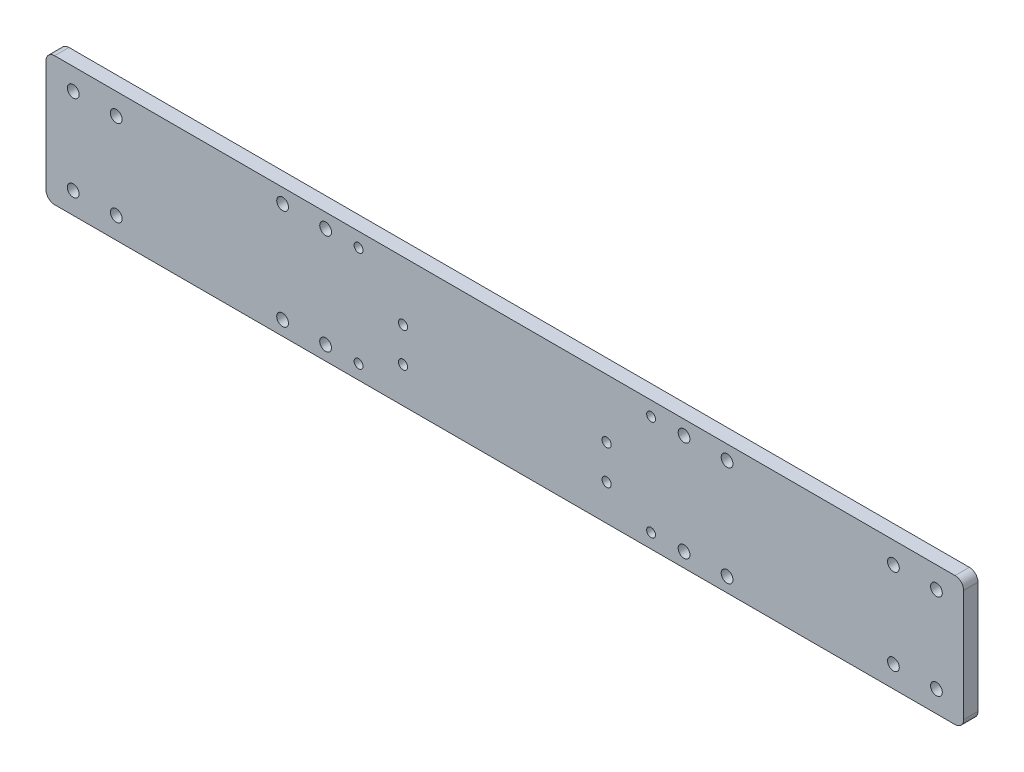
ISO-10303-21;
HEADER;
FILE_DESCRIPTION(('STEP AP214'),'2;1');
FILE_NAME('part.step','',(''),(''),'','','');
FILE_SCHEMA(('AUTOMOTIVE_DESIGN { 1 0 10303 214 1 1 1 1 }'));
ENDSEC;
DATA;
#1=APPLICATION_CONTEXT('core data for automotive mechanical design processes');
#2=APPLICATION_PROTOCOL_DEFINITION('international standard','automotive_design',2000,#1);
#3=PRODUCT_CONTEXT('',#1,'mechanical');
#4=PRODUCT('Part','Part','',(#3));
#5=PRODUCT_RELATED_PRODUCT_CATEGORY('part','',(#4));
#6=PRODUCT_DEFINITION_FORMATION('','',#4);
#7=PRODUCT_DEFINITION_CONTEXT('part definition',#1,'design');
#8=PRODUCT_DEFINITION('design','',#6,#7);
#9=PRODUCT_DEFINITION_SHAPE('','',#8);
#10=(LENGTH_UNIT() NAMED_UNIT(*) SI_UNIT(.MILLI.,.METRE.));
#11=(NAMED_UNIT(*) PLANE_ANGLE_UNIT() SI_UNIT($,.RADIAN.));
#12=(NAMED_UNIT(*) SI_UNIT($,.STERADIAN.) SOLID_ANGLE_UNIT());
#13=UNCERTAINTY_MEASURE_WITH_UNIT(LENGTH_MEASURE(1.E-05),#10,'distance_accuracy_value','');
#14=(GEOMETRIC_REPRESENTATION_CONTEXT(3) GLOBAL_UNCERTAINTY_ASSIGNED_CONTEXT((#13)) GLOBAL_UNIT_ASSIGNED_CONTEXT((#10,
#11,#12)) REPRESENTATION_CONTEXT('',''));
#15=CARTESIAN_POINT('',(0.,0.,0.));
#16=DIRECTION('',(0.,0.,1.));
#17=DIRECTION('',(1.,0.,0.));
#18=AXIS2_PLACEMENT_3D('',#15,#16,#17);
#19=CARTESIAN_POINT('',(0.,0.,5.));
#20=DIRECTION('',(0.,0.,-1.));
#21=DIRECTION('',(-1.,0.,0.));
#22=AXIS2_PLACEMENT_3D('',#19,#20,#21);
#23=PLANE('',#22);
#24=CARTESIAN_POINT('',(35.5,1.99999999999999,5.));
#25=DIRECTION('',(0.,0.,1.));
#26=DIRECTION('',(1.,0.,0.));
#27=AXIS2_PLACEMENT_3D('',#24,#25,#26);
#28=CIRCLE('',#27,1.6);
#29=CARTESIAN_POINT('',(37.1,1.99999999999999,5.));
#30=VERTEX_POINT('',#29);
#31=EDGE_CURVE('E162',#30,#30,#28,.T.);
#32=ORIENTED_EDGE('',*,*,#31,.F.);
#33=EDGE_LOOP('',(#32));
#34=FACE_BOUND('',#33,.T.);
#35=CARTESIAN_POINT('',(35.5000000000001,-10.,5.));
#36=DIRECTION('',(0.,0.,1.));
#37=DIRECTION('',(1.,0.,0.));
#38=AXIS2_PLACEMENT_3D('',#35,#36,#37);
#39=CIRCLE('',#38,1.6);
#40=CARTESIAN_POINT('',(37.1000000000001,-10.,5.));
#41=VERTEX_POINT('',#40);
#42=EDGE_CURVE('E319',#41,#41,#39,.T.);
#43=ORIENTED_EDGE('',*,*,#42,.F.);
#44=EDGE_LOOP('',(#43));
#45=FACE_BOUND('',#44,.T.);
#46=CARTESIAN_POINT('',(-35.4999999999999,-10.,5.));
#47=DIRECTION('',(0.,0.,1.));
#48=DIRECTION('',(1.,0.,0.));
#49=AXIS2_PLACEMENT_3D('',#46,#47,#48);
#50=CIRCLE('',#49,1.6);
#51=CARTESIAN_POINT('',(-33.8999999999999,-10.,5.));
#52=VERTEX_POINT('',#51);
#53=EDGE_CURVE('E316',#52,#52,#50,.T.);
#54=ORIENTED_EDGE('',*,*,#53,.F.);
#55=EDGE_LOOP('',(#54));
#56=FACE_BOUND('',#55,.T.);
#57=CARTESIAN_POINT('',(-35.5,1.99999999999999,5.));
#58=DIRECTION('',(0.,0.,1.));
#59=DIRECTION('',(1.,0.,0.));
#60=AXIS2_PLACEMENT_3D('',#57,#58,#59);
#61=CIRCLE('',#60,1.6);
#62=CARTESIAN_POINT('',(-33.9,1.99999999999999,5.));
#63=VERTEX_POINT('',#62);
#64=EDGE_CURVE('E157',#63,#63,#61,.T.);
#65=ORIENTED_EDGE('',*,*,#64,.F.);
#66=EDGE_LOOP('',(#65));
#67=FACE_BOUND('',#66,.T.);
#68=CARTESIAN_POINT('',(51.0000000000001,17.5,5.));
#69=DIRECTION('',(0.,0.,1.));
#70=DIRECTION('',(1.,0.,0.));
#71=AXIS2_PLACEMENT_3D('',#68,#69,#70);
#72=CIRCLE('',#71,1.54999999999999);
#73=CARTESIAN_POINT('',(52.5500000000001,17.5,5.));
#74=VERTEX_POINT('',#73);
#75=EDGE_CURVE('E147',#74,#74,#72,.T.);
#76=ORIENTED_EDGE('',*,*,#75,.F.);
#77=EDGE_LOOP('',(#76));
#78=FACE_BOUND('',#77,.T.);
#79=CARTESIAN_POINT('',(-50.9999999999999,-17.5,5.));
#80=DIRECTION('',(0.,0.,1.));
#81=DIRECTION('',(-1.,0.,0.));
#82=AXIS2_PLACEMENT_3D('',#79,#80,#81);
#83=CIRCLE('',#82,1.54999999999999);
#84=CARTESIAN_POINT('',(-52.5499999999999,-17.5,5.));
#85=VERTEX_POINT('',#84);
#86=EDGE_CURVE('E309',#85,#85,#83,.T.);
#87=ORIENTED_EDGE('',*,*,#86,.F.);
#88=EDGE_LOOP('',(#87));
#89=FACE_BOUND('',#88,.T.);
#90=CARTESIAN_POINT('',(51.0000000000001,-17.5,5.));
#91=DIRECTION('',(0.,0.,1.));
#92=DIRECTION('',(-1.,0.,0.));
#93=AXIS2_PLACEMENT_3D('',#90,#91,#92);
#94=CIRCLE('',#93,1.54999999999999);
#95=CARTESIAN_POINT('',(49.4500000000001,-17.5,5.));
#96=VERTEX_POINT('',#95);
#97=EDGE_CURVE('E156',#96,#96,#94,.T.);
#98=ORIENTED_EDGE('',*,*,#97,.F.);
#99=EDGE_LOOP('',(#98));
#100=FACE_BOUND('',#99,.T.);
#101=CARTESIAN_POINT('',(-50.9999999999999,17.5,5.));
#102=DIRECTION('',(0.,0.,1.));
#103=DIRECTION('',(1.,0.,0.));
#104=AXIS2_PLACEMENT_3D('',#101,#102,#103);
#105=CIRCLE('',#104,1.54999999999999);
#106=CARTESIAN_POINT('',(-49.4499999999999,17.5,5.));
#107=VERTEX_POINT('',#106);
#108=EDGE_CURVE('E142',#107,#107,#105,.T.);
#109=ORIENTED_EDGE('',*,*,#108,.F.);
#110=EDGE_LOOP('',(#109));
#111=FACE_BOUND('',#110,.T.);
#112=DIRECTION('',(-1.,0.,0.));
#113=VECTOR('',#112,1.);
#114=CARTESIAN_POINT('',(0.,22.5,5.));
#115=LINE('',#114,#113);
#116=CARTESIAN_POINT('',(157.,22.5,5.));
#117=VERTEX_POINT('',#116);
#118=CARTESIAN_POINT('',(-157.,22.5,5.));
#119=VERTEX_POINT('',#118);
#120=EDGE_CURVE('E201',#117,#119,#115,.T.);
#121=ORIENTED_EDGE('',*,*,#120,.T.);
#122=CARTESIAN_POINT('',(-157.,19.5,5.));
#123=DIRECTION('',(0.,0.,-1.));
#124=DIRECTION('',(-1.,0.,0.));
#125=AXIS2_PLACEMENT_3D('',#122,#123,#124);
#126=CIRCLE('',#125,3.);
#127=CARTESIAN_POINT('',(-160.,19.5,5.));
#128=VERTEX_POINT('',#127);
#129=EDGE_CURVE('E182',#119,#128,#126,.F.);
#130=ORIENTED_EDGE('',*,*,#129,.T.);
#131=DIRECTION('',(0.,-1.,0.));
#132=VECTOR('',#131,1.);
#133=CARTESIAN_POINT('',(-160.,-22.5,5.));
#134=LINE('',#133,#132);
#135=CARTESIAN_POINT('',(-160.,-19.5,5.));
#136=VERTEX_POINT('',#135);
#137=EDGE_CURVE('E122',#128,#136,#134,.T.);
#138=ORIENTED_EDGE('',*,*,#137,.T.);
#139=CARTESIAN_POINT('',(-157.,-19.5,5.));
#140=DIRECTION('',(0.,0.,-1.));
#141=DIRECTION('',(-1.,0.,0.));
#142=AXIS2_PLACEMENT_3D('',#139,#140,#141);
#143=CIRCLE('',#142,3.);
#144=CARTESIAN_POINT('',(-157.,-22.5,5.));
#145=VERTEX_POINT('',#144);
#146=EDGE_CURVE('E58',#136,#145,#143,.F.);
#147=ORIENTED_EDGE('',*,*,#146,.T.);
#148=DIRECTION('',(1.,0.,0.));
#149=VECTOR('',#148,1.);
#150=CARTESIAN_POINT('',(-160.,-22.5,5.));
#151=LINE('',#150,#149);
#152=CARTESIAN_POINT('',(157.,-22.5,5.));
#153=VERTEX_POINT('',#152);
#154=EDGE_CURVE('E168',#145,#153,#151,.T.);
#155=ORIENTED_EDGE('',*,*,#154,.T.);
#156=CARTESIAN_POINT('',(157.,-19.5,5.));
#157=DIRECTION('',(0.,0.,-1.));
#158=DIRECTION('',(-1.,0.,0.));
#159=AXIS2_PLACEMENT_3D('',#156,#157,#158);
#160=CIRCLE('',#159,3.);
#161=CARTESIAN_POINT('',(160.,-19.5,5.));
#162=VERTEX_POINT('',#161);
#163=EDGE_CURVE('E179',#153,#162,#160,.F.);
#164=ORIENTED_EDGE('',*,*,#163,.T.);
#165=DIRECTION('',(0.,1.,0.));
#166=VECTOR('',#165,1.);
#167=CARTESIAN_POINT('',(160.,-22.5,5.));
#168=LINE('',#167,#166);
#169=CARTESIAN_POINT('',(160.,19.5,5.));
#170=VERTEX_POINT('',#169);
#171=EDGE_CURVE('E132',#162,#170,#168,.T.);
#172=ORIENTED_EDGE('',*,*,#171,.T.);
#173=CARTESIAN_POINT('',(157.,19.5,5.));
#174=DIRECTION('',(0.,0.,-1.));
#175=DIRECTION('',(-1.,0.,0.));
#176=AXIS2_PLACEMENT_3D('',#173,#174,#175);
#177=CIRCLE('',#176,3.);
#178=EDGE_CURVE('E177',#170,#117,#177,.F.);
#179=ORIENTED_EDGE('',*,*,#178,.T.);
#180=EDGE_LOOP('',(#121,#130,#138,#147,#155,#164,#172,#179));
#181=FACE_BOUND('',#180,.T.);
#182=CARTESIAN_POINT('',(-150.5,15.,5.));
#183=DIRECTION('',(0.,0.,1.));
#184=DIRECTION('',(1.,0.,0.));
#185=AXIS2_PLACEMENT_3D('',#182,#183,#184);
#186=CIRCLE('',#185,2.04999999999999);
#187=CARTESIAN_POINT('',(-148.45,15.,5.));
#188=VERTEX_POINT('',#187);
#189=EDGE_CURVE('E206',#188,#188,#186,.T.);
#190=ORIENTED_EDGE('',*,*,#189,.F.);
#191=EDGE_LOOP('',(#190));
#192=FACE_BOUND('',#191,.T.);
#193=CARTESIAN_POINT('',(-77.5,17.5,5.));
#194=DIRECTION('',(0.,0.,1.));
#195=DIRECTION('',(1.,0.,0.));
#196=AXIS2_PLACEMENT_3D('',#193,#194,#195);
#197=CIRCLE('',#196,2.04999999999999);
#198=CARTESIAN_POINT('',(-75.45,17.5,5.));
#199=VERTEX_POINT('',#198);
#200=EDGE_CURVE('E215',#199,#199,#197,.T.);
#201=ORIENTED_EDGE('',*,*,#200,.F.);
#202=EDGE_LOOP('',(#201));
#203=FACE_BOUND('',#202,.T.);
#204=CARTESIAN_POINT('',(62.5000000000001,-17.5,5.));
#205=DIRECTION('',(0.,0.,1.));
#206=DIRECTION('',(-1.,0.,0.));
#207=AXIS2_PLACEMENT_3D('',#204,#205,#206);
#208=CIRCLE('',#207,2.04999999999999);
#209=CARTESIAN_POINT('',(60.4500000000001,-17.5,5.));
#210=VERTEX_POINT('',#209);
#211=EDGE_CURVE('E220',#210,#210,#208,.T.);
#212=ORIENTED_EDGE('',*,*,#211,.F.);
#213=EDGE_LOOP('',(#212));
#214=FACE_BOUND('',#213,.T.);
#215=CARTESIAN_POINT('',(150.5,15.,5.));
#216=DIRECTION('',(0.,0.,1.));
#217=DIRECTION('',(-1.,0.,0.));
#218=AXIS2_PLACEMENT_3D('',#215,#216,#217);
#219=CIRCLE('',#218,2.04999999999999);
#220=CARTESIAN_POINT('',(148.45,15.,5.));
#221=VERTEX_POINT('',#220);
#222=EDGE_CURVE('E226',#221,#221,#219,.T.);
#223=ORIENTED_EDGE('',*,*,#222,.F.);
#224=EDGE_LOOP('',(#223));
#225=FACE_BOUND('',#224,.T.);
#226=CARTESIAN_POINT('',(-135.5,15.,5.));
#227=DIRECTION('',(0.,0.,1.));
#228=DIRECTION('',(1.,0.,0.));
#229=AXIS2_PLACEMENT_3D('',#226,#227,#228);
#230=CIRCLE('',#229,2.04999999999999);
#231=CARTESIAN_POINT('',(-133.45,15.,5.));
#232=VERTEX_POINT('',#231);
#233=EDGE_CURVE('E232',#232,#232,#230,.T.);
#234=ORIENTED_EDGE('',*,*,#233,.F.);
#235=EDGE_LOOP('',(#234));
#236=FACE_BOUND('',#235,.T.);
#237=CARTESIAN_POINT('',(-135.5,-15.,5.));
#238=DIRECTION('',(0.,0.,1.));
#239=DIRECTION('',(1.,0.,0.));
#240=AXIS2_PLACEMENT_3D('',#237,#238,#239);
#241=CIRCLE('',#240,2.04999999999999);
#242=CARTESIAN_POINT('',(-133.45,-15.,5.));
#243=VERTEX_POINT('',#242);
#244=EDGE_CURVE('E238',#243,#243,#241,.T.);
#245=ORIENTED_EDGE('',*,*,#244,.F.);
#246=EDGE_LOOP('',(#245));
#247=FACE_BOUND('',#246,.T.);
#248=CARTESIAN_POINT('',(-150.5,-15.,5.));
#249=DIRECTION('',(0.,0.,1.));
#250=DIRECTION('',(1.,0.,0.));
#251=AXIS2_PLACEMENT_3D('',#248,#249,#250);
#252=CIRCLE('',#251,2.04999999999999);
#253=CARTESIAN_POINT('',(-148.45,-15.,5.));
#254=VERTEX_POINT('',#253);
#255=EDGE_CURVE('E244',#254,#254,#252,.T.);
#256=ORIENTED_EDGE('',*,*,#255,.F.);
#257=EDGE_LOOP('',(#256));
#258=FACE_BOUND('',#257,.T.);
#259=CARTESIAN_POINT('',(150.5,-15.,5.));
#260=DIRECTION('',(0.,0.,1.));
#261=DIRECTION('',(-1.,0.,0.));
#262=AXIS2_PLACEMENT_3D('',#259,#260,#261);
#263=CIRCLE('',#262,2.04999999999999);
#264=CARTESIAN_POINT('',(148.45,-15.,5.));
#265=VERTEX_POINT('',#264);
#266=EDGE_CURVE('E250',#265,#265,#263,.T.);
#267=ORIENTED_EDGE('',*,*,#266,.F.);
#268=EDGE_LOOP('',(#267));
#269=FACE_BOUND('',#268,.T.);
#270=CARTESIAN_POINT('',(135.5,-15.,5.));
#271=DIRECTION('',(0.,0.,1.));
#272=DIRECTION('',(-1.,0.,0.));
#273=AXIS2_PLACEMENT_3D('',#270,#271,#272);
#274=CIRCLE('',#273,2.04999999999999);
#275=CARTESIAN_POINT('',(133.45,-15.,5.));
#276=VERTEX_POINT('',#275);
#277=EDGE_CURVE('E256',#276,#276,#274,.T.);
#278=ORIENTED_EDGE('',*,*,#277,.F.);
#279=EDGE_LOOP('',(#278));
#280=FACE_BOUND('',#279,.T.);
#281=CARTESIAN_POINT('',(135.5,15.,5.));
#282=DIRECTION('',(0.,0.,1.));
#283=DIRECTION('',(-1.,0.,0.));
#284=AXIS2_PLACEMENT_3D('',#281,#282,#283);
#285=CIRCLE('',#284,2.04999999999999);
#286=CARTESIAN_POINT('',(133.45,15.,5.));
#287=VERTEX_POINT('',#286);
#288=EDGE_CURVE('E262',#287,#287,#285,.T.);
#289=ORIENTED_EDGE('',*,*,#288,.F.);
#290=EDGE_LOOP('',(#289));
#291=FACE_BOUND('',#290,.T.);
#292=CARTESIAN_POINT('',(-62.5,17.5,5.));
#293=DIRECTION('',(0.,0.,1.));
#294=DIRECTION('',(1.,0.,0.));
#295=AXIS2_PLACEMENT_3D('',#292,#293,#294);
#296=CIRCLE('',#295,2.04999999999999);
#297=CARTESIAN_POINT('',(-60.45,17.5,5.));
#298=VERTEX_POINT('',#297);
#299=EDGE_CURVE('E268',#298,#298,#296,.T.);
#300=ORIENTED_EDGE('',*,*,#299,.F.);
#301=EDGE_LOOP('',(#300));
#302=FACE_BOUND('',#301,.T.);
#303=CARTESIAN_POINT('',(-62.5,-17.5,5.));
#304=DIRECTION('',(0.,0.,1.));
#305=DIRECTION('',(1.,0.,0.));
#306=AXIS2_PLACEMENT_3D('',#303,#304,#305);
#307=CIRCLE('',#306,2.05);
#308=CARTESIAN_POINT('',(-60.45,-17.5,5.));
#309=VERTEX_POINT('',#308);
#310=EDGE_CURVE('E274',#309,#309,#307,.T.);
#311=ORIENTED_EDGE('',*,*,#310,.F.);
#312=EDGE_LOOP('',(#311));
#313=FACE_BOUND('',#312,.T.);
#314=CARTESIAN_POINT('',(-77.5,-17.5,5.));
#315=DIRECTION('',(0.,0.,1.));
#316=DIRECTION('',(1.,0.,0.));
#317=AXIS2_PLACEMENT_3D('',#314,#315,#316);
#318=CIRCLE('',#317,2.04999999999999);
#319=CARTESIAN_POINT('',(-75.45,-17.5,5.));
#320=VERTEX_POINT('',#319);
#321=EDGE_CURVE('E280',#320,#320,#318,.T.);
#322=ORIENTED_EDGE('',*,*,#321,.F.);
#323=EDGE_LOOP('',(#322));
#324=FACE_BOUND('',#323,.T.);
#325=CARTESIAN_POINT('',(77.5000000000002,-17.5,5.));
#326=DIRECTION('',(0.,0.,1.));
#327=DIRECTION('',(-1.,0.,0.));
#328=AXIS2_PLACEMENT_3D('',#325,#326,#327);
#329=CIRCLE('',#328,2.04999999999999);
#330=CARTESIAN_POINT('',(75.4500000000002,-17.5,5.));
#331=VERTEX_POINT('',#330);
#332=EDGE_CURVE('E286',#331,#331,#329,.T.);
#333=ORIENTED_EDGE('',*,*,#332,.F.);
#334=EDGE_LOOP('',(#333));
#335=FACE_BOUND('',#334,.T.);
#336=CARTESIAN_POINT('',(62.5000000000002,17.5,5.));
#337=DIRECTION('',(0.,0.,1.));
#338=DIRECTION('',(-1.,0.,0.));
#339=AXIS2_PLACEMENT_3D('',#336,#337,#338);
#340=CIRCLE('',#339,2.04999999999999);
#341=CARTESIAN_POINT('',(60.4500000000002,17.5,5.));
#342=VERTEX_POINT('',#341);
#343=EDGE_CURVE('E292',#342,#342,#340,.T.);
#344=ORIENTED_EDGE('',*,*,#343,.F.);
#345=EDGE_LOOP('',(#344));
#346=FACE_BOUND('',#345,.T.);
#347=CARTESIAN_POINT('',(77.5000000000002,17.5,5.));
#348=DIRECTION('',(0.,0.,1.));
#349=DIRECTION('',(-1.,0.,0.));
#350=AXIS2_PLACEMENT_3D('',#347,#348,#349);
#351=CIRCLE('',#350,2.04999999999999);
#352=CARTESIAN_POINT('',(75.4500000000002,17.5,5.));
#353=VERTEX_POINT('',#352);
#354=EDGE_CURVE('E298',#353,#353,#351,.T.);
#355=ORIENTED_EDGE('',*,*,#354,.F.);
#356=EDGE_LOOP('',(#355));
#357=FACE_BOUND('',#356,.T.);
#358=ADVANCED_FACE('F36',(#34,#45,#56,#67,#78,#89,#100,#111,#181,#192,#203,#214,#225,#236,#247,
#258,#269,#280,#291,#302,#313,#324,#335,#346,#357),#23,.F.);
#359=CARTESIAN_POINT('',(0.,0.,0.));
#360=DIRECTION('',(0.,0.,-1.));
#361=DIRECTION('',(-1.,0.,0.));
#362=AXIS2_PLACEMENT_3D('',#359,#360,#361);
#363=PLANE('',#362);
#364=CARTESIAN_POINT('',(35.5,1.99999999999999,0.));
#365=DIRECTION('',(0.,0.,-1.));
#366=DIRECTION('',(-1.,0.,0.));
#367=AXIS2_PLACEMENT_3D('',#364,#365,#366);
#368=CIRCLE('',#367,1.6);
#369=CARTESIAN_POINT('',(33.9,1.99999999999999,0.));
#370=VERTEX_POINT('',#369);
#371=EDGE_CURVE('E165',#370,#370,#368,.T.);
#372=ORIENTED_EDGE('',*,*,#371,.F.);
#373=EDGE_LOOP('',(#372));
#374=FACE_BOUND('',#373,.T.);
#375=CARTESIAN_POINT('',(35.5000000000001,-10.,0.));
#376=DIRECTION('',(0.,0.,-1.));
#377=DIRECTION('',(-1.,0.,0.));
#378=AXIS2_PLACEMENT_3D('',#375,#376,#377);
#379=CIRCLE('',#378,1.6);
#380=CARTESIAN_POINT('',(33.9000000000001,-10.,0.));
#381=VERTEX_POINT('',#380);
#382=EDGE_CURVE('E161',#381,#381,#379,.T.);
#383=ORIENTED_EDGE('',*,*,#382,.F.);
#384=EDGE_LOOP('',(#383));
#385=FACE_BOUND('',#384,.T.);
#386=CARTESIAN_POINT('',(-35.4999999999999,-10.,0.));
#387=DIRECTION('',(0.,0.,-1.));
#388=DIRECTION('',(-1.,0.,0.));
#389=AXIS2_PLACEMENT_3D('',#386,#387,#388);
#390=CIRCLE('',#389,1.6);
#391=CARTESIAN_POINT('',(-37.0999999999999,-10.,0.));
#392=VERTEX_POINT('',#391);
#393=EDGE_CURVE('E158',#392,#392,#390,.T.);
#394=ORIENTED_EDGE('',*,*,#393,.F.);
#395=EDGE_LOOP('',(#394));
#396=FACE_BOUND('',#395,.T.);
#397=CARTESIAN_POINT('',(-35.5,1.99999999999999,0.));
#398=DIRECTION('',(0.,0.,-1.));
#399=DIRECTION('',(-1.,0.,0.));
#400=AXIS2_PLACEMENT_3D('',#397,#398,#399);
#401=CIRCLE('',#400,1.6);
#402=CARTESIAN_POINT('',(-37.1,1.99999999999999,0.));
#403=VERTEX_POINT('',#402);
#404=EDGE_CURVE('E153',#403,#403,#401,.T.);
#405=ORIENTED_EDGE('',*,*,#404,.F.);
#406=EDGE_LOOP('',(#405));
#407=FACE_BOUND('',#406,.T.);
#408=CARTESIAN_POINT('',(51.0000000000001,17.5,0.));
#409=DIRECTION('',(0.,0.,-1.));
#410=DIRECTION('',(-1.,0.,0.));
#411=AXIS2_PLACEMENT_3D('',#408,#409,#410);
#412=CIRCLE('',#411,1.54999999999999);
#413=CARTESIAN_POINT('',(49.4500000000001,17.5,0.));
#414=VERTEX_POINT('',#413);
#415=EDGE_CURVE('E150',#414,#414,#412,.T.);
#416=ORIENTED_EDGE('',*,*,#415,.F.);
#417=EDGE_LOOP('',(#416));
#418=FACE_BOUND('',#417,.T.);
#419=CARTESIAN_POINT('',(-50.9999999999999,-17.5,0.));
#420=DIRECTION('',(0.,0.,-1.));
#421=DIRECTION('',(-1.,0.,0.));
#422=AXIS2_PLACEMENT_3D('',#419,#420,#421);
#423=CIRCLE('',#422,1.54999999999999);
#424=CARTESIAN_POINT('',(-52.5499999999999,-17.5,0.));
#425=VERTEX_POINT('',#424);
#426=EDGE_CURVE('E146',#425,#425,#423,.T.);
#427=ORIENTED_EDGE('',*,*,#426,.F.);
#428=EDGE_LOOP('',(#427));
#429=FACE_BOUND('',#428,.T.);
#430=CARTESIAN_POINT('',(51.0000000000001,-17.5,0.));
#431=DIRECTION('',(0.,0.,-1.));
#432=DIRECTION('',(-1.,0.,0.));
#433=AXIS2_PLACEMENT_3D('',#430,#431,#432);
#434=CIRCLE('',#433,1.54999999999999);
#435=CARTESIAN_POINT('',(49.4500000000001,-17.5,0.));
#436=VERTEX_POINT('',#435);
#437=EDGE_CURVE('E143',#436,#436,#434,.T.);
#438=ORIENTED_EDGE('',*,*,#437,.F.);
#439=EDGE_LOOP('',(#438));
#440=FACE_BOUND('',#439,.T.);
#441=CARTESIAN_POINT('',(-50.9999999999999,17.5,0.));
#442=DIRECTION('',(0.,0.,-1.));
#443=DIRECTION('',(-1.,0.,0.));
#444=AXIS2_PLACEMENT_3D('',#441,#442,#443);
#445=CIRCLE('',#444,1.54999999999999);
#446=CARTESIAN_POINT('',(-52.5499999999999,17.5,0.));
#447=VERTEX_POINT('',#446);
#448=EDGE_CURVE('E138',#447,#447,#445,.T.);
#449=ORIENTED_EDGE('',*,*,#448,.F.);
#450=EDGE_LOOP('',(#449));
#451=FACE_BOUND('',#450,.T.);
#452=CARTESIAN_POINT('',(62.5000000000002,17.5,0.));
#453=DIRECTION('',(0.,0.,1.));
#454=DIRECTION('',(-1.,0.,0.));
#455=AXIS2_PLACEMENT_3D('',#452,#453,#454);
#456=CIRCLE('',#455,2.04999999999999);
#457=CARTESIAN_POINT('',(60.4500000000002,17.5,0.));
#458=VERTEX_POINT('',#457);
#459=EDGE_CURVE('E295',#458,#458,#456,.T.);
#460=ORIENTED_EDGE('',*,*,#459,.T.);
#461=EDGE_LOOP('',(#460));
#462=FACE_BOUND('',#461,.T.);
#463=CARTESIAN_POINT('',(-77.5,-17.5,0.));
#464=DIRECTION('',(0.,0.,1.));
#465=DIRECTION('',(1.,0.,0.));
#466=AXIS2_PLACEMENT_3D('',#463,#464,#465);
#467=CIRCLE('',#466,2.04999999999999);
#468=CARTESIAN_POINT('',(-75.45,-17.5,0.));
#469=VERTEX_POINT('',#468);
#470=EDGE_CURVE('E283',#469,#469,#467,.T.);
#471=ORIENTED_EDGE('',*,*,#470,.T.);
#472=EDGE_LOOP('',(#471));
#473=FACE_BOUND('',#472,.T.);
#474=CARTESIAN_POINT('',(-62.5,17.5,0.));
#475=DIRECTION('',(0.,0.,1.));
#476=DIRECTION('',(1.,0.,0.));
#477=AXIS2_PLACEMENT_3D('',#474,#475,#476);
#478=CIRCLE('',#477,2.04999999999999);
#479=CARTESIAN_POINT('',(-60.45,17.5,0.));
#480=VERTEX_POINT('',#479);
#481=EDGE_CURVE('E271',#480,#480,#478,.T.);
#482=ORIENTED_EDGE('',*,*,#481,.T.);
#483=EDGE_LOOP('',(#482));
#484=FACE_BOUND('',#483,.T.);
#485=CARTESIAN_POINT('',(135.5,-15.,0.));
#486=DIRECTION('',(0.,0.,1.));
#487=DIRECTION('',(-1.,0.,0.));
#488=AXIS2_PLACEMENT_3D('',#485,#486,#487);
#489=CIRCLE('',#488,2.04999999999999);
#490=CARTESIAN_POINT('',(133.45,-15.,0.));
#491=VERTEX_POINT('',#490);
#492=EDGE_CURVE('E259',#491,#491,#489,.T.);
#493=ORIENTED_EDGE('',*,*,#492,.T.);
#494=EDGE_LOOP('',(#493));
#495=FACE_BOUND('',#494,.T.);
#496=CARTESIAN_POINT('',(-150.5,-15.,0.));
#497=DIRECTION('',(0.,0.,1.));
#498=DIRECTION('',(1.,0.,0.));
#499=AXIS2_PLACEMENT_3D('',#496,#497,#498);
#500=CIRCLE('',#499,2.04999999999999);
#501=CARTESIAN_POINT('',(-148.45,-15.,0.));
#502=VERTEX_POINT('',#501);
#503=EDGE_CURVE('E247',#502,#502,#500,.T.);
#504=ORIENTED_EDGE('',*,*,#503,.T.);
#505=EDGE_LOOP('',(#504));
#506=FACE_BOUND('',#505,.T.);
#507=CARTESIAN_POINT('',(-135.5,15.,0.));
#508=DIRECTION('',(0.,0.,1.));
#509=DIRECTION('',(1.,0.,0.));
#510=AXIS2_PLACEMENT_3D('',#507,#508,#509);
#511=CIRCLE('',#510,2.04999999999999);
#512=CARTESIAN_POINT('',(-133.45,15.,0.));
#513=VERTEX_POINT('',#512);
#514=EDGE_CURVE('E235',#513,#513,#511,.T.);
#515=ORIENTED_EDGE('',*,*,#514,.T.);
#516=EDGE_LOOP('',(#515));
#517=FACE_BOUND('',#516,.T.);
#518=CARTESIAN_POINT('',(62.5000000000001,-17.5,0.));
#519=DIRECTION('',(0.,0.,1.));
#520=DIRECTION('',(-1.,0.,0.));
#521=AXIS2_PLACEMENT_3D('',#518,#519,#520);
#522=CIRCLE('',#521,2.04999999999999);
#523=CARTESIAN_POINT('',(60.4500000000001,-17.5,0.));
#524=VERTEX_POINT('',#523);
#525=EDGE_CURVE('E223',#524,#524,#522,.T.);
#526=ORIENTED_EDGE('',*,*,#525,.T.);
#527=EDGE_LOOP('',(#526));
#528=FACE_BOUND('',#527,.T.);
#529=CARTESIAN_POINT('',(-150.5,15.,0.));
#530=DIRECTION('',(0.,0.,1.));
#531=DIRECTION('',(1.,0.,0.));
#532=AXIS2_PLACEMENT_3D('',#529,#530,#531);
#533=CIRCLE('',#532,2.04999999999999);
#534=CARTESIAN_POINT('',(-148.45,15.,0.));
#535=VERTEX_POINT('',#534);
#536=EDGE_CURVE('E208',#535,#535,#533,.T.);
#537=ORIENTED_EDGE('',*,*,#536,.T.);
#538=EDGE_LOOP('',(#537));
#539=FACE_BOUND('',#538,.T.);
#540=DIRECTION('',(0.,-1.,0.));
#541=VECTOR('',#540,1.);
#542=CARTESIAN_POINT('',(-160.,-22.5,0.));
#543=LINE('',#542,#541);
#544=CARTESIAN_POINT('',(-160.,19.5,0.));
#545=VERTEX_POINT('',#544);
#546=CARTESIAN_POINT('',(-160.,-19.5,0.));
#547=VERTEX_POINT('',#546);
#548=EDGE_CURVE('E120',#545,#547,#543,.T.);
#549=ORIENTED_EDGE('',*,*,#548,.F.);
#550=CARTESIAN_POINT('',(-157.,19.5,0.));
#551=DIRECTION('',(0.,0.,-1.));
#552=DIRECTION('',(-1.,0.,0.));
#553=AXIS2_PLACEMENT_3D('',#550,#551,#552);
#554=CIRCLE('',#553,3.);
#555=CARTESIAN_POINT('',(-157.,22.5,0.));
#556=VERTEX_POINT('',#555);
#557=EDGE_CURVE('E103',#545,#556,#554,.T.);
#558=ORIENTED_EDGE('',*,*,#557,.T.);
#559=DIRECTION('',(-1.,0.,0.));
#560=VECTOR('',#559,1.);
#561=CARTESIAN_POINT('',(0.,22.5,0.));
#562=LINE('',#561,#560);
#563=CARTESIAN_POINT('',(157.,22.5,0.));
#564=VERTEX_POINT('',#563);
#565=EDGE_CURVE('E130',#564,#556,#562,.T.);
#566=ORIENTED_EDGE('',*,*,#565,.F.);
#567=CARTESIAN_POINT('',(157.,19.5,0.));
#568=DIRECTION('',(0.,0.,-1.));
#569=DIRECTION('',(-1.,0.,0.));
#570=AXIS2_PLACEMENT_3D('',#567,#568,#569);
#571=CIRCLE('',#570,3.);
#572=CARTESIAN_POINT('',(160.,19.5,0.));
#573=VERTEX_POINT('',#572);
#574=EDGE_CURVE('E123',#564,#573,#571,.T.);
#575=ORIENTED_EDGE('',*,*,#574,.T.);
#576=DIRECTION('',(0.,1.,0.));
#577=VECTOR('',#576,1.);
#578=CARTESIAN_POINT('',(160.,-22.5,0.));
#579=LINE('',#578,#577);
#580=CARTESIAN_POINT('',(160.,-19.5,0.));
#581=VERTEX_POINT('',#580);
#582=EDGE_CURVE('E134',#581,#573,#579,.T.);
#583=ORIENTED_EDGE('',*,*,#582,.F.);
#584=CARTESIAN_POINT('',(157.,-19.5,0.));
#585=DIRECTION('',(0.,0.,-1.));
#586=DIRECTION('',(-1.,0.,0.));
#587=AXIS2_PLACEMENT_3D('',#584,#585,#586);
#588=CIRCLE('',#587,3.);
#589=CARTESIAN_POINT('',(157.,-22.5,0.));
#590=VERTEX_POINT('',#589);
#591=EDGE_CURVE('E171',#581,#590,#588,.T.);
#592=ORIENTED_EDGE('',*,*,#591,.T.);
#593=DIRECTION('',(1.,0.,0.));
#594=VECTOR('',#593,1.);
#595=CARTESIAN_POINT('',(-160.,-22.5,0.));
#596=LINE('',#595,#594);
#597=CARTESIAN_POINT('',(-157.,-22.5,0.));
#598=VERTEX_POINT('',#597);
#599=EDGE_CURVE('E129',#598,#590,#596,.T.);
#600=ORIENTED_EDGE('',*,*,#599,.F.);
#601=CARTESIAN_POINT('',(-157.,-19.5,0.));
#602=DIRECTION('',(0.,0.,-1.));
#603=DIRECTION('',(-1.,0.,0.));
#604=AXIS2_PLACEMENT_3D('',#601,#602,#603);
#605=CIRCLE('',#604,3.);
#606=EDGE_CURVE('E114',#598,#547,#605,.T.);
#607=ORIENTED_EDGE('',*,*,#606,.T.);
#608=EDGE_LOOP('',(#549,#558,#566,#575,#583,#592,#600,#607));
#609=FACE_BOUND('',#608,.T.);
#610=CARTESIAN_POINT('',(-77.5,17.5,0.));
#611=DIRECTION('',(0.,0.,1.));
#612=DIRECTION('',(1.,0.,0.));
#613=AXIS2_PLACEMENT_3D('',#610,#611,#612);
#614=CIRCLE('',#613,2.04999999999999);
#615=CARTESIAN_POINT('',(-75.45,17.5,0.));
#616=VERTEX_POINT('',#615);
#617=EDGE_CURVE('E217',#616,#616,#614,.T.);
#618=ORIENTED_EDGE('',*,*,#617,.T.);
#619=EDGE_LOOP('',(#618));
#620=FACE_BOUND('',#619,.T.);
#621=CARTESIAN_POINT('',(150.5,15.,0.));
#622=DIRECTION('',(0.,0.,1.));
#623=DIRECTION('',(-1.,0.,0.));
#624=AXIS2_PLACEMENT_3D('',#621,#622,#623);
#625=CIRCLE('',#624,2.04999999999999);
#626=CARTESIAN_POINT('',(148.45,15.,0.));
#627=VERTEX_POINT('',#626);
#628=EDGE_CURVE('E229',#627,#627,#625,.T.);
#629=ORIENTED_EDGE('',*,*,#628,.T.);
#630=EDGE_LOOP('',(#629));
#631=FACE_BOUND('',#630,.T.);
#632=CARTESIAN_POINT('',(-135.5,-15.,0.));
#633=DIRECTION('',(0.,0.,1.));
#634=DIRECTION('',(1.,0.,0.));
#635=AXIS2_PLACEMENT_3D('',#632,#633,#634);
#636=CIRCLE('',#635,2.04999999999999);
#637=CARTESIAN_POINT('',(-133.45,-15.,0.));
#638=VERTEX_POINT('',#637);
#639=EDGE_CURVE('E241',#638,#638,#636,.T.);
#640=ORIENTED_EDGE('',*,*,#639,.T.);
#641=EDGE_LOOP('',(#640));
#642=FACE_BOUND('',#641,.T.);
#643=CARTESIAN_POINT('',(150.5,-15.,0.));
#644=DIRECTION('',(0.,0.,1.));
#645=DIRECTION('',(-1.,0.,0.));
#646=AXIS2_PLACEMENT_3D('',#643,#644,#645);
#647=CIRCLE('',#646,2.04999999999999);
#648=CARTESIAN_POINT('',(148.45,-15.,0.));
#649=VERTEX_POINT('',#648);
#650=EDGE_CURVE('E253',#649,#649,#647,.T.);
#651=ORIENTED_EDGE('',*,*,#650,.T.);
#652=EDGE_LOOP('',(#651));
#653=FACE_BOUND('',#652,.T.);
#654=CARTESIAN_POINT('',(135.5,15.,0.));
#655=DIRECTION('',(0.,0.,1.));
#656=DIRECTION('',(-1.,0.,0.));
#657=AXIS2_PLACEMENT_3D('',#654,#655,#656);
#658=CIRCLE('',#657,2.04999999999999);
#659=CARTESIAN_POINT('',(133.45,15.,0.));
#660=VERTEX_POINT('',#659);
#661=EDGE_CURVE('E265',#660,#660,#658,.T.);
#662=ORIENTED_EDGE('',*,*,#661,.T.);
#663=EDGE_LOOP('',(#662));
#664=FACE_BOUND('',#663,.T.);
#665=CARTESIAN_POINT('',(-62.5,-17.5,0.));
#666=DIRECTION('',(0.,0.,1.));
#667=DIRECTION('',(1.,0.,0.));
#668=AXIS2_PLACEMENT_3D('',#665,#666,#667);
#669=CIRCLE('',#668,2.05);
#670=CARTESIAN_POINT('',(-60.45,-17.5,0.));
#671=VERTEX_POINT('',#670);
#672=EDGE_CURVE('E277',#671,#671,#669,.T.);
#673=ORIENTED_EDGE('',*,*,#672,.T.);
#674=EDGE_LOOP('',(#673));
#675=FACE_BOUND('',#674,.T.);
#676=CARTESIAN_POINT('',(77.5000000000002,-17.5,0.));
#677=DIRECTION('',(0.,0.,1.));
#678=DIRECTION('',(-1.,0.,0.));
#679=AXIS2_PLACEMENT_3D('',#676,#677,#678);
#680=CIRCLE('',#679,2.04999999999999);
#681=CARTESIAN_POINT('',(75.4500000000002,-17.5,0.));
#682=VERTEX_POINT('',#681);
#683=EDGE_CURVE('E289',#682,#682,#680,.T.);
#684=ORIENTED_EDGE('',*,*,#683,.T.);
#685=EDGE_LOOP('',(#684));
#686=FACE_BOUND('',#685,.T.);
#687=CARTESIAN_POINT('',(77.5000000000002,17.5,0.));
#688=DIRECTION('',(0.,0.,1.));
#689=DIRECTION('',(-1.,0.,0.));
#690=AXIS2_PLACEMENT_3D('',#687,#688,#689);
#691=CIRCLE('',#690,2.04999999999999);
#692=CARTESIAN_POINT('',(75.4500000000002,17.5,0.));
#693=VERTEX_POINT('',#692);
#694=EDGE_CURVE('E141',#693,#693,#691,.T.);
#695=ORIENTED_EDGE('',*,*,#694,.T.);
#696=EDGE_LOOP('',(#695));
#697=FACE_BOUND('',#696,.T.);
#698=ADVANCED_FACE('F126',(#374,#385,#396,#407,#418,#429,#440,#451,#462,#473,#484,#495,#506,
#517,#528,#539,#609,#620,#631,#642,#653,#664,#675,#686,#697),#363,.T.);
#699=CARTESIAN_POINT('',(160.,-22.5,5.));
#700=DIRECTION('',(-1.,0.,0.));
#701=DIRECTION('',(0.,0.,1.));
#702=AXIS2_PLACEMENT_3D('',#699,#700,#701);
#703=PLANE('',#702);
#704=ORIENTED_EDGE('',*,*,#171,.F.);
#705=DIRECTION('',(0.,0.,-1.));
#706=VECTOR('',#705,1.);
#707=CARTESIAN_POINT('',(160.,-19.5,5.));
#708=LINE('',#707,#706);
#709=EDGE_CURVE('E11',#162,#581,#708,.T.);
#710=ORIENTED_EDGE('',*,*,#709,.T.);
#711=ORIENTED_EDGE('',*,*,#582,.T.);
#712=DIRECTION('',(0.,0.,-1.));
#713=VECTOR('',#712,1.);
#714=CARTESIAN_POINT('',(160.,19.5,5.));
#715=LINE('',#714,#713);
#716=EDGE_CURVE('E44',#573,#170,#715,.F.);
#717=ORIENTED_EDGE('',*,*,#716,.T.);
#718=EDGE_LOOP('',(#704,#710,#711,#717));
#719=FACE_BOUND('',#718,.T.);
#720=ADVANCED_FACE('F192',(#719),#703,.F.);
#721=CARTESIAN_POINT('',(0.,22.5,5.));
#722=DIRECTION('',(0.,-1.,0.));
#723=DIRECTION('',(1.,0.,0.));
#724=AXIS2_PLACEMENT_3D('',#721,#722,#723);
#725=PLANE('',#724);
#726=ORIENTED_EDGE('',*,*,#565,.T.);
#727=DIRECTION('',(0.,0.,-1.));
#728=VECTOR('',#727,1.);
#729=CARTESIAN_POINT('',(-157.,22.5,5.));
#730=LINE('',#729,#728);
#731=EDGE_CURVE('E108',#556,#119,#730,.F.);
#732=ORIENTED_EDGE('',*,*,#731,.T.);
#733=ORIENTED_EDGE('',*,*,#120,.F.);
#734=DIRECTION('',(0.,0.,-1.));
#735=VECTOR('',#734,1.);
#736=CARTESIAN_POINT('',(157.,22.5,5.));
#737=LINE('',#736,#735);
#738=EDGE_CURVE('E113',#117,#564,#737,.T.);
#739=ORIENTED_EDGE('',*,*,#738,.T.);
#740=EDGE_LOOP('',(#726,#732,#733,#739));
#741=FACE_BOUND('',#740,.T.);
#742=ADVANCED_FACE('F205',(#741),#725,.F.);
#743=CARTESIAN_POINT('',(-160.,-22.5,5.));
#744=DIRECTION('',(1.,0.,0.));
#745=DIRECTION('',(0.,0.,-1.));
#746=AXIS2_PLACEMENT_3D('',#743,#744,#745);
#747=PLANE('',#746);
#748=ORIENTED_EDGE('',*,*,#137,.F.);
#749=DIRECTION('',(0.,0.,-1.));
#750=VECTOR('',#749,1.);
#751=CARTESIAN_POINT('',(-160.,19.5,5.));
#752=LINE('',#751,#750);
#753=EDGE_CURVE('E107',#128,#545,#752,.T.);
#754=ORIENTED_EDGE('',*,*,#753,.T.);
#755=ORIENTED_EDGE('',*,*,#548,.T.);
#756=DIRECTION('',(0.,0.,-1.));
#757=VECTOR('',#756,1.);
#758=CARTESIAN_POINT('',(-160.,-19.5,5.));
#759=LINE('',#758,#757);
#760=EDGE_CURVE('E124',#547,#136,#759,.F.);
#761=ORIENTED_EDGE('',*,*,#760,.T.);
#762=EDGE_LOOP('',(#748,#754,#755,#761));
#763=FACE_BOUND('',#762,.T.);
#764=ADVANCED_FACE('F119',(#763),#747,.F.);
#765=CARTESIAN_POINT('',(-160.,-22.5,5.));
#766=DIRECTION('',(0.,1.,0.));
#767=DIRECTION('',(0.,0.,1.));
#768=AXIS2_PLACEMENT_3D('',#765,#766,#767);
#769=PLANE('',#768);
#770=ORIENTED_EDGE('',*,*,#154,.F.);
#771=DIRECTION('',(0.,0.,-1.));
#772=VECTOR('',#771,1.);
#773=CARTESIAN_POINT('',(-157.,-22.5,5.));
#774=LINE('',#773,#772);
#775=EDGE_CURVE('E185',#145,#598,#774,.T.);
#776=ORIENTED_EDGE('',*,*,#775,.T.);
#777=ORIENTED_EDGE('',*,*,#599,.T.);
#778=DIRECTION('',(0.,0.,-1.));
#779=VECTOR('',#778,1.);
#780=CARTESIAN_POINT('',(157.,-22.5,5.));
#781=LINE('',#780,#779);
#782=EDGE_CURVE('E51',#590,#153,#781,.F.);
#783=ORIENTED_EDGE('',*,*,#782,.T.);
#784=EDGE_LOOP('',(#770,#776,#777,#783));
#785=FACE_BOUND('',#784,.T.);
#786=ADVANCED_FACE('F419',(#785),#769,.F.);
#787=CARTESIAN_POINT('',(-150.5,15.,5.));
#788=DIRECTION('',(0.,0.,-1.));
#789=DIRECTION('',(-1.,0.,0.));
#790=AXIS2_PLACEMENT_3D('',#787,#788,#789);
#791=CYLINDRICAL_SURFACE('',#790,2.04999999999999);
#792=ORIENTED_EDGE('',*,*,#189,.T.);
#793=EDGE_LOOP('',(#792));
#794=FACE_BOUND('',#793,.T.);
#795=ORIENTED_EDGE('',*,*,#536,.F.);
#796=EDGE_LOOP('',(#795));
#797=FACE_BOUND('',#796,.T.);
#798=ADVANCED_FACE('F416',(#794,#797),#791,.F.);
#799=CARTESIAN_POINT('',(-77.5,17.5,5.));
#800=DIRECTION('',(0.,0.,-1.));
#801=DIRECTION('',(-1.,0.,0.));
#802=AXIS2_PLACEMENT_3D('',#799,#800,#801);
#803=CYLINDRICAL_SURFACE('',#802,2.04999999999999);
#804=ORIENTED_EDGE('',*,*,#200,.T.);
#805=EDGE_LOOP('',(#804));
#806=FACE_BOUND('',#805,.T.);
#807=ORIENTED_EDGE('',*,*,#617,.F.);
#808=EDGE_LOOP('',(#807));
#809=FACE_BOUND('',#808,.T.);
#810=ADVANCED_FACE('F412',(#806,#809),#803,.F.);
#811=CARTESIAN_POINT('',(62.5000000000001,-17.5,5.));
#812=DIRECTION('',(0.,0.,-1.));
#813=DIRECTION('',(-1.,0.,0.));
#814=AXIS2_PLACEMENT_3D('',#811,#812,#813);
#815=CYLINDRICAL_SURFACE('',#814,2.04999999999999);
#816=ORIENTED_EDGE('',*,*,#211,.T.);
#817=EDGE_LOOP('',(#816));
#818=FACE_BOUND('',#817,.T.);
#819=ORIENTED_EDGE('',*,*,#525,.F.);
#820=EDGE_LOOP('',(#819));
#821=FACE_BOUND('',#820,.T.);
#822=ADVANCED_FACE('F408',(#818,#821),#815,.F.);
#823=CARTESIAN_POINT('',(150.5,15.,5.));
#824=DIRECTION('',(0.,0.,-1.));
#825=DIRECTION('',(-1.,0.,0.));
#826=AXIS2_PLACEMENT_3D('',#823,#824,#825);
#827=CYLINDRICAL_SURFACE('',#826,2.04999999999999);
#828=ORIENTED_EDGE('',*,*,#222,.T.);
#829=EDGE_LOOP('',(#828));
#830=FACE_BOUND('',#829,.T.);
#831=ORIENTED_EDGE('',*,*,#628,.F.);
#832=EDGE_LOOP('',(#831));
#833=FACE_BOUND('',#832,.T.);
#834=ADVANCED_FACE('F404',(#830,#833),#827,.F.);
#835=CARTESIAN_POINT('',(-135.5,15.,5.));
#836=DIRECTION('',(0.,0.,-1.));
#837=DIRECTION('',(-1.,0.,0.));
#838=AXIS2_PLACEMENT_3D('',#835,#836,#837);
#839=CYLINDRICAL_SURFACE('',#838,2.04999999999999);
#840=ORIENTED_EDGE('',*,*,#233,.T.);
#841=EDGE_LOOP('',(#840));
#842=FACE_BOUND('',#841,.T.);
#843=ORIENTED_EDGE('',*,*,#514,.F.);
#844=EDGE_LOOP('',(#843));
#845=FACE_BOUND('',#844,.T.);
#846=ADVANCED_FACE('F400',(#842,#845),#839,.F.);
#847=CARTESIAN_POINT('',(-135.5,-15.,5.));
#848=DIRECTION('',(0.,0.,-1.));
#849=DIRECTION('',(-1.,0.,0.));
#850=AXIS2_PLACEMENT_3D('',#847,#848,#849);
#851=CYLINDRICAL_SURFACE('',#850,2.04999999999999);
#852=ORIENTED_EDGE('',*,*,#244,.T.);
#853=EDGE_LOOP('',(#852));
#854=FACE_BOUND('',#853,.T.);
#855=ORIENTED_EDGE('',*,*,#639,.F.);
#856=EDGE_LOOP('',(#855));
#857=FACE_BOUND('',#856,.T.);
#858=ADVANCED_FACE('F396',(#854,#857),#851,.F.);
#859=CARTESIAN_POINT('',(-150.5,-15.,5.));
#860=DIRECTION('',(0.,0.,-1.));
#861=DIRECTION('',(-1.,0.,0.));
#862=AXIS2_PLACEMENT_3D('',#859,#860,#861);
#863=CYLINDRICAL_SURFACE('',#862,2.04999999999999);
#864=ORIENTED_EDGE('',*,*,#255,.T.);
#865=EDGE_LOOP('',(#864));
#866=FACE_BOUND('',#865,.T.);
#867=ORIENTED_EDGE('',*,*,#503,.F.);
#868=EDGE_LOOP('',(#867));
#869=FACE_BOUND('',#868,.T.);
#870=ADVANCED_FACE('F392',(#866,#869),#863,.F.);
#871=CARTESIAN_POINT('',(150.5,-15.,5.));
#872=DIRECTION('',(0.,0.,-1.));
#873=DIRECTION('',(-1.,0.,0.));
#874=AXIS2_PLACEMENT_3D('',#871,#872,#873);
#875=CYLINDRICAL_SURFACE('',#874,2.04999999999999);
#876=ORIENTED_EDGE('',*,*,#266,.T.);
#877=EDGE_LOOP('',(#876));
#878=FACE_BOUND('',#877,.T.);
#879=ORIENTED_EDGE('',*,*,#650,.F.);
#880=EDGE_LOOP('',(#879));
#881=FACE_BOUND('',#880,.T.);
#882=ADVANCED_FACE('F388',(#878,#881),#875,.F.);
#883=CARTESIAN_POINT('',(135.5,-15.,5.));
#884=DIRECTION('',(0.,0.,-1.));
#885=DIRECTION('',(-1.,0.,0.));
#886=AXIS2_PLACEMENT_3D('',#883,#884,#885);
#887=CYLINDRICAL_SURFACE('',#886,2.04999999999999);
#888=ORIENTED_EDGE('',*,*,#277,.T.);
#889=EDGE_LOOP('',(#888));
#890=FACE_BOUND('',#889,.T.);
#891=ORIENTED_EDGE('',*,*,#492,.F.);
#892=EDGE_LOOP('',(#891));
#893=FACE_BOUND('',#892,.T.);
#894=ADVANCED_FACE('F384',(#890,#893),#887,.F.);
#895=CARTESIAN_POINT('',(135.5,15.,5.));
#896=DIRECTION('',(0.,0.,-1.));
#897=DIRECTION('',(-1.,0.,0.));
#898=AXIS2_PLACEMENT_3D('',#895,#896,#897);
#899=CYLINDRICAL_SURFACE('',#898,2.04999999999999);
#900=ORIENTED_EDGE('',*,*,#288,.T.);
#901=EDGE_LOOP('',(#900));
#902=FACE_BOUND('',#901,.T.);
#903=ORIENTED_EDGE('',*,*,#661,.F.);
#904=EDGE_LOOP('',(#903));
#905=FACE_BOUND('',#904,.T.);
#906=ADVANCED_FACE('F380',(#902,#905),#899,.F.);
#907=CARTESIAN_POINT('',(-62.5,17.5,5.));
#908=DIRECTION('',(0.,0.,-1.));
#909=DIRECTION('',(-1.,0.,0.));
#910=AXIS2_PLACEMENT_3D('',#907,#908,#909);
#911=CYLINDRICAL_SURFACE('',#910,2.04999999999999);
#912=ORIENTED_EDGE('',*,*,#299,.T.);
#913=EDGE_LOOP('',(#912));
#914=FACE_BOUND('',#913,.T.);
#915=ORIENTED_EDGE('',*,*,#481,.F.);
#916=EDGE_LOOP('',(#915));
#917=FACE_BOUND('',#916,.T.);
#918=ADVANCED_FACE('F376',(#914,#917),#911,.F.);
#919=CARTESIAN_POINT('',(-62.5,-17.5,5.));
#920=DIRECTION('',(0.,0.,-1.));
#921=DIRECTION('',(-1.,0.,0.));
#922=AXIS2_PLACEMENT_3D('',#919,#920,#921);
#923=CYLINDRICAL_SURFACE('',#922,2.05);
#924=ORIENTED_EDGE('',*,*,#310,.T.);
#925=EDGE_LOOP('',(#924));
#926=FACE_BOUND('',#925,.T.);
#927=ORIENTED_EDGE('',*,*,#672,.F.);
#928=EDGE_LOOP('',(#927));
#929=FACE_BOUND('',#928,.T.);
#930=ADVANCED_FACE('F372',(#926,#929),#923,.F.);
#931=CARTESIAN_POINT('',(-77.5,-17.5,5.));
#932=DIRECTION('',(0.,0.,-1.));
#933=DIRECTION('',(-1.,0.,0.));
#934=AXIS2_PLACEMENT_3D('',#931,#932,#933);
#935=CYLINDRICAL_SURFACE('',#934,2.04999999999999);
#936=ORIENTED_EDGE('',*,*,#321,.T.);
#937=EDGE_LOOP('',(#936));
#938=FACE_BOUND('',#937,.T.);
#939=ORIENTED_EDGE('',*,*,#470,.F.);
#940=EDGE_LOOP('',(#939));
#941=FACE_BOUND('',#940,.T.);
#942=ADVANCED_FACE('F368',(#938,#941),#935,.F.);
#943=CARTESIAN_POINT('',(77.5000000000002,-17.5,5.));
#944=DIRECTION('',(0.,0.,-1.));
#945=DIRECTION('',(-1.,0.,0.));
#946=AXIS2_PLACEMENT_3D('',#943,#944,#945);
#947=CYLINDRICAL_SURFACE('',#946,2.04999999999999);
#948=ORIENTED_EDGE('',*,*,#332,.T.);
#949=EDGE_LOOP('',(#948));
#950=FACE_BOUND('',#949,.T.);
#951=ORIENTED_EDGE('',*,*,#683,.F.);
#952=EDGE_LOOP('',(#951));
#953=FACE_BOUND('',#952,.T.);
#954=ADVANCED_FACE('F364',(#950,#953),#947,.F.);
#955=CARTESIAN_POINT('',(62.5000000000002,17.5,5.));
#956=DIRECTION('',(0.,0.,-1.));
#957=DIRECTION('',(-1.,0.,0.));
#958=AXIS2_PLACEMENT_3D('',#955,#956,#957);
#959=CYLINDRICAL_SURFACE('',#958,2.04999999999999);
#960=ORIENTED_EDGE('',*,*,#343,.T.);
#961=EDGE_LOOP('',(#960));
#962=FACE_BOUND('',#961,.T.);
#963=ORIENTED_EDGE('',*,*,#459,.F.);
#964=EDGE_LOOP('',(#963));
#965=FACE_BOUND('',#964,.T.);
#966=ADVANCED_FACE('F357',(#962,#965),#959,.F.);
#967=CARTESIAN_POINT('',(77.5000000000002,17.5,5.));
#968=DIRECTION('',(0.,0.,-1.));
#969=DIRECTION('',(-1.,0.,0.));
#970=AXIS2_PLACEMENT_3D('',#967,#968,#969);
#971=CYLINDRICAL_SURFACE('',#970,2.04999999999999);
#972=ORIENTED_EDGE('',*,*,#354,.T.);
#973=EDGE_LOOP('',(#972));
#974=FACE_BOUND('',#973,.T.);
#975=ORIENTED_EDGE('',*,*,#694,.F.);
#976=EDGE_LOOP('',(#975));
#977=FACE_BOUND('',#976,.T.);
#978=ADVANCED_FACE('F347',(#974,#977),#971,.F.);
#979=CARTESIAN_POINT('',(-50.9999999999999,17.5,-5.));
#980=DIRECTION('',(0.,0.,1.));
#981=DIRECTION('',(1.,0.,0.));
#982=AXIS2_PLACEMENT_3D('',#979,#980,#981);
#983=CYLINDRICAL_SURFACE('',#982,1.54999999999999);
#984=ORIENTED_EDGE('',*,*,#448,.T.);
#985=EDGE_LOOP('',(#984));
#986=FACE_BOUND('',#985,.T.);
#987=ORIENTED_EDGE('',*,*,#108,.T.);
#988=EDGE_LOOP('',(#987));
#989=FACE_BOUND('',#988,.T.);
#990=ADVANCED_FACE('F344',(#986,#989),#983,.F.);
#991=CARTESIAN_POINT('',(51.0000000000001,-17.5,-5.));
#992=DIRECTION('',(0.,0.,1.));
#993=DIRECTION('',(1.,0.,0.));
#994=AXIS2_PLACEMENT_3D('',#991,#992,#993);
#995=CYLINDRICAL_SURFACE('',#994,1.54999999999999);
#996=ORIENTED_EDGE('',*,*,#437,.T.);
#997=EDGE_LOOP('',(#996));
#998=FACE_BOUND('',#997,.T.);
#999=ORIENTED_EDGE('',*,*,#97,.T.);
#1000=EDGE_LOOP('',(#999));
#1001=FACE_BOUND('',#1000,.T.);
#1002=ADVANCED_FACE('F346',(#998,#1001),#995,.F.);
#1003=CARTESIAN_POINT('',(-50.9999999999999,-17.5,-5.));
#1004=DIRECTION('',(0.,0.,1.));
#1005=DIRECTION('',(1.,0.,0.));
#1006=AXIS2_PLACEMENT_3D('',#1003,#1004,#1005);
#1007=CYLINDRICAL_SURFACE('',#1006,1.54999999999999);
#1008=ORIENTED_EDGE('',*,*,#426,.T.);
#1009=EDGE_LOOP('',(#1008));
#1010=FACE_BOUND('',#1009,.T.);
#1011=ORIENTED_EDGE('',*,*,#86,.T.);
#1012=EDGE_LOOP('',(#1011));
#1013=FACE_BOUND('',#1012,.T.);
#1014=ADVANCED_FACE('F354',(#1010,#1013),#1007,.F.);
#1015=CARTESIAN_POINT('',(51.0000000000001,17.5,-5.));
#1016=DIRECTION('',(0.,0.,1.));
#1017=DIRECTION('',(1.,0.,0.));
#1018=AXIS2_PLACEMENT_3D('',#1015,#1016,#1017);
#1019=CYLINDRICAL_SURFACE('',#1018,1.54999999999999);
#1020=ORIENTED_EDGE('',*,*,#415,.T.);
#1021=EDGE_LOOP('',(#1020));
#1022=FACE_BOUND('',#1021,.T.);
#1023=ORIENTED_EDGE('',*,*,#75,.T.);
#1024=EDGE_LOOP('',(#1023));
#1025=FACE_BOUND('',#1024,.T.);
#1026=ADVANCED_FACE('F539',(#1022,#1025),#1019,.F.);
#1027=CARTESIAN_POINT('',(-35.5,1.99999999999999,-5.));
#1028=DIRECTION('',(0.,0.,1.));
#1029=DIRECTION('',(1.,0.,0.));
#1030=AXIS2_PLACEMENT_3D('',#1027,#1028,#1029);
#1031=CYLINDRICAL_SURFACE('',#1030,1.6);
#1032=ORIENTED_EDGE('',*,*,#404,.T.);
#1033=EDGE_LOOP('',(#1032));
#1034=FACE_BOUND('',#1033,.T.);
#1035=ORIENTED_EDGE('',*,*,#64,.T.);
#1036=EDGE_LOOP('',(#1035));
#1037=FACE_BOUND('',#1036,.T.);
#1038=ADVANCED_FACE('F529',(#1034,#1037),#1031,.F.);
#1039=CARTESIAN_POINT('',(-35.4999999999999,-10.,-5.));
#1040=DIRECTION('',(0.,0.,1.));
#1041=DIRECTION('',(1.,0.,0.));
#1042=AXIS2_PLACEMENT_3D('',#1039,#1040,#1041);
#1043=CYLINDRICAL_SURFACE('',#1042,1.6);
#1044=ORIENTED_EDGE('',*,*,#393,.T.);
#1045=EDGE_LOOP('',(#1044));
#1046=FACE_BOUND('',#1045,.T.);
#1047=ORIENTED_EDGE('',*,*,#53,.T.);
#1048=EDGE_LOOP('',(#1047));
#1049=FACE_BOUND('',#1048,.T.);
#1050=ADVANCED_FACE('F519',(#1046,#1049),#1043,.F.);
#1051=CARTESIAN_POINT('',(35.5000000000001,-10.,-5.));
#1052=DIRECTION('',(0.,0.,1.));
#1053=DIRECTION('',(1.,0.,0.));
#1054=AXIS2_PLACEMENT_3D('',#1051,#1052,#1053);
#1055=CYLINDRICAL_SURFACE('',#1054,1.6);
#1056=ORIENTED_EDGE('',*,*,#382,.T.);
#1057=EDGE_LOOP('',(#1056));
#1058=FACE_BOUND('',#1057,.T.);
#1059=ORIENTED_EDGE('',*,*,#42,.T.);
#1060=EDGE_LOOP('',(#1059));
#1061=FACE_BOUND('',#1060,.T.);
#1062=ADVANCED_FACE('F509',(#1058,#1061),#1055,.F.);
#1063=CARTESIAN_POINT('',(35.5,1.99999999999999,-5.));
#1064=DIRECTION('',(0.,0.,1.));
#1065=DIRECTION('',(1.,0.,0.));
#1066=AXIS2_PLACEMENT_3D('',#1063,#1064,#1065);
#1067=CYLINDRICAL_SURFACE('',#1066,1.6);
#1068=ORIENTED_EDGE('',*,*,#371,.T.);
#1069=EDGE_LOOP('',(#1068));
#1070=FACE_BOUND('',#1069,.T.);
#1071=ORIENTED_EDGE('',*,*,#31,.T.);
#1072=EDGE_LOOP('',(#1071));
#1073=FACE_BOUND('',#1072,.T.);
#1074=ADVANCED_FACE('F325',(#1070,#1073),#1067,.F.);
#1075=CARTESIAN_POINT('',(-157.,19.5,5.));
#1076=DIRECTION('',(0.,0.,-1.));
#1077=DIRECTION('',(-1.,0.,0.));
#1078=AXIS2_PLACEMENT_3D('',#1075,#1076,#1077);
#1079=CYLINDRICAL_SURFACE('',#1078,3.);
#1080=ORIENTED_EDGE('',*,*,#129,.F.);
#1081=ORIENTED_EDGE('',*,*,#731,.F.);
#1082=ORIENTED_EDGE('',*,*,#557,.F.);
#1083=ORIENTED_EDGE('',*,*,#753,.F.);
#1084=EDGE_LOOP('',(#1080,#1081,#1082,#1083));
#1085=FACE_BOUND('',#1084,.T.);
#1086=ADVANCED_FACE('F106',(#1085),#1079,.T.);
#1087=CARTESIAN_POINT('',(-157.,-19.5,5.));
#1088=DIRECTION('',(0.,0.,-1.));
#1089=DIRECTION('',(-1.,0.,0.));
#1090=AXIS2_PLACEMENT_3D('',#1087,#1088,#1089);
#1091=CYLINDRICAL_SURFACE('',#1090,3.);
#1092=ORIENTED_EDGE('',*,*,#146,.F.);
#1093=ORIENTED_EDGE('',*,*,#760,.F.);
#1094=ORIENTED_EDGE('',*,*,#606,.F.);
#1095=ORIENTED_EDGE('',*,*,#775,.F.);
#1096=EDGE_LOOP('',(#1092,#1093,#1094,#1095));
#1097=FACE_BOUND('',#1096,.T.);
#1098=ADVANCED_FACE('F435',(#1097),#1091,.T.);
#1099=CARTESIAN_POINT('',(157.,-19.5,5.));
#1100=DIRECTION('',(0.,0.,-1.));
#1101=DIRECTION('',(-1.,0.,0.));
#1102=AXIS2_PLACEMENT_3D('',#1099,#1100,#1101);
#1103=CYLINDRICAL_SURFACE('',#1102,3.);
#1104=ORIENTED_EDGE('',*,*,#163,.F.);
#1105=ORIENTED_EDGE('',*,*,#782,.F.);
#1106=ORIENTED_EDGE('',*,*,#591,.F.);
#1107=ORIENTED_EDGE('',*,*,#709,.F.);
#1108=EDGE_LOOP('',(#1104,#1105,#1106,#1107));
#1109=FACE_BOUND('',#1108,.T.);
#1110=ADVANCED_FACE('F437',(#1109),#1103,.T.);
#1111=CARTESIAN_POINT('',(157.,19.5,5.));
#1112=DIRECTION('',(0.,0.,-1.));
#1113=DIRECTION('',(-1.,0.,0.));
#1114=AXIS2_PLACEMENT_3D('',#1111,#1112,#1113);
#1115=CYLINDRICAL_SURFACE('',#1114,3.);
#1116=ORIENTED_EDGE('',*,*,#178,.F.);
#1117=ORIENTED_EDGE('',*,*,#716,.F.);
#1118=ORIENTED_EDGE('',*,*,#574,.F.);
#1119=ORIENTED_EDGE('',*,*,#738,.F.);
#1120=EDGE_LOOP('',(#1116,#1117,#1118,#1119));
#1121=FACE_BOUND('',#1120,.T.);
#1122=ADVANCED_FACE('F38',(#1121),#1115,.T.);
#1123=CLOSED_SHELL('',(#358,#698,#720,#742,#764,#786,#798,#810,#822,#834,#846,#858,#870,#882,
#894,#906,#918,#930,#942,#954,#966,#978,#990,#1002,#1014,#1026,#1038,#1050,#1062,#1074,#1086,
#1098,#1110,#1122));
#1124=MANIFOLD_SOLID_BREP('B2',#1123);
#1125=ADVANCED_BREP_SHAPE_REPRESENTATION('',(#18,#1124),#14);
#1126=SHAPE_DEFINITION_REPRESENTATION(#9,#1125);
ENDSEC;
END-ISO-10303-21;
